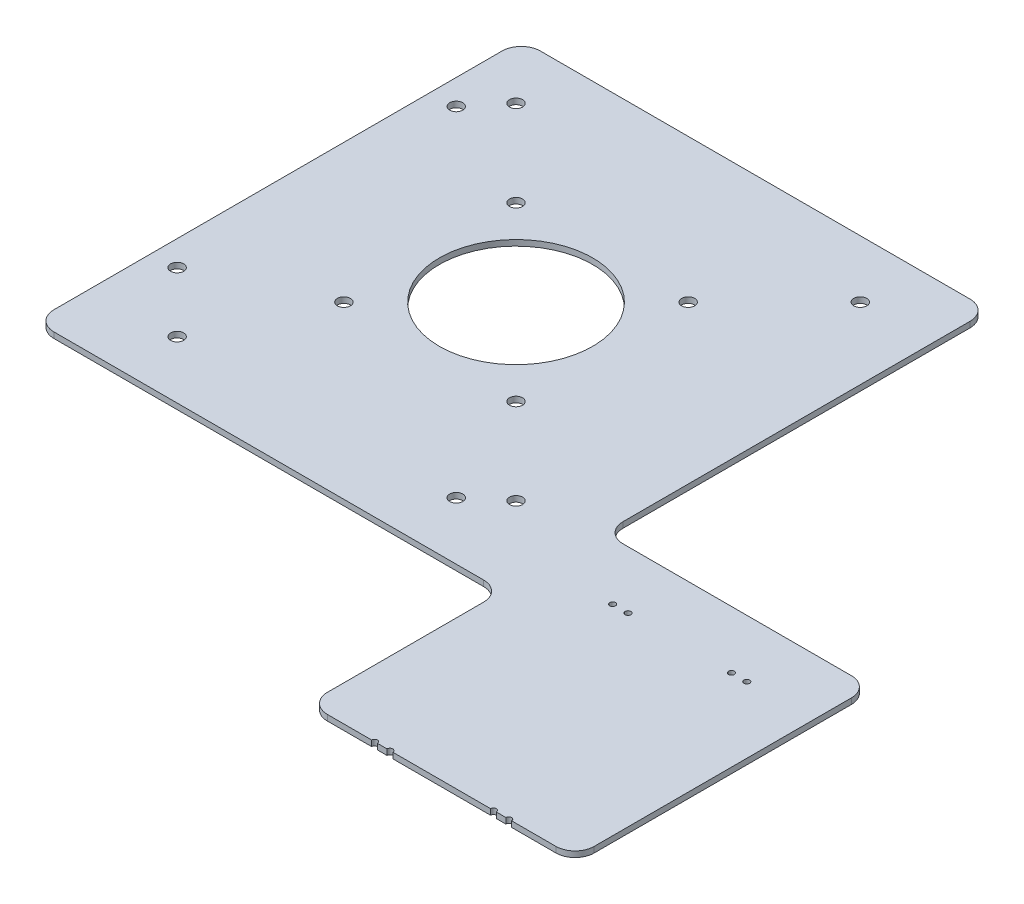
ISO-10303-21;
HEADER;
FILE_DESCRIPTION(('STEP AP214'),'2;1');
FILE_NAME('part.step','',(''),(''),'','','');
FILE_SCHEMA(('AUTOMOTIVE_DESIGN { 1 0 10303 214 1 1 1 1 }'));
ENDSEC;
DATA;
#1=APPLICATION_CONTEXT('core data for automotive mechanical design processes');
#2=APPLICATION_PROTOCOL_DEFINITION('international standard','automotive_design',2000,#1);
#3=PRODUCT_CONTEXT('',#1,'mechanical');
#4=PRODUCT('Part','Part','',(#3));
#5=PRODUCT_RELATED_PRODUCT_CATEGORY('part','',(#4));
#6=PRODUCT_DEFINITION_FORMATION('','',#4);
#7=PRODUCT_DEFINITION_CONTEXT('part definition',#1,'design');
#8=PRODUCT_DEFINITION('design','',#6,#7);
#9=PRODUCT_DEFINITION_SHAPE('','',#8);
#10=(LENGTH_UNIT() NAMED_UNIT(*) SI_UNIT(.MILLI.,.METRE.));
#11=(NAMED_UNIT(*) PLANE_ANGLE_UNIT() SI_UNIT($,.RADIAN.));
#12=(NAMED_UNIT(*) SI_UNIT($,.STERADIAN.) SOLID_ANGLE_UNIT());
#13=UNCERTAINTY_MEASURE_WITH_UNIT(LENGTH_MEASURE(1.E-05),#10,'distance_accuracy_value','');
#14=(GEOMETRIC_REPRESENTATION_CONTEXT(3) GLOBAL_UNCERTAINTY_ASSIGNED_CONTEXT((#13)) GLOBAL_UNIT_ASSIGNED_CONTEXT((#10,
#11,#12)) REPRESENTATION_CONTEXT('',''));
#15=CARTESIAN_POINT('',(0.,0.,0.));
#16=DIRECTION('',(0.,0.,1.));
#17=DIRECTION('',(1.,0.,0.));
#18=AXIS2_PLACEMENT_3D('',#15,#16,#17);
#19=CARTESIAN_POINT('',(256.3,3.,91.3));
#20=DIRECTION('',(0.,1.,0.));
#21=DIRECTION('',(0.,0.,1.));
#22=AXIS2_PLACEMENT_3D('',#19,#20,#21);
#23=PLANE('',#22);
#24=CARTESIAN_POINT('',(223.7,3.,111.3));
#25=DIRECTION('',(0.,1.,0.));
#26=DIRECTION('',(0.,0.,1.));
#27=AXIS2_PLACEMENT_3D('',#24,#25,#26);
#28=CIRCLE('',#27,1.5);
#29=CARTESIAN_POINT('',(223.7,3.,112.8));
#30=VERTEX_POINT('',#29);
#31=EDGE_CURVE('E568',#30,#30,#28,.T.);
#32=ORIENTED_EDGE('',*,*,#31,.F.);
#33=EDGE_LOOP('',(#32));
#34=FACE_BOUND('',#33,.T.);
#35=CARTESIAN_POINT('',(161.7,3.,111.3));
#36=DIRECTION('',(0.,1.,0.));
#37=DIRECTION('',(0.,0.,1.));
#38=AXIS2_PLACEMENT_3D('',#35,#36,#37);
#39=CIRCLE('',#38,1.5);
#40=CARTESIAN_POINT('',(161.7,3.,112.8));
#41=VERTEX_POINT('',#40);
#42=EDGE_CURVE('E580',#41,#41,#39,.T.);
#43=ORIENTED_EDGE('',*,*,#42,.F.);
#44=EDGE_LOOP('',(#43));
#45=FACE_BOUND('',#44,.T.);
#46=CARTESIAN_POINT('',(89.8,3.,89.8));
#47=DIRECTION('',(0.,1.,0.));
#48=DIRECTION('',(0.,0.,1.));
#49=AXIS2_PLACEMENT_3D('',#46,#47,#48);
#50=CIRCLE('',#49,3.4);
#51=CARTESIAN_POINT('',(89.8,3.,93.2));
#52=VERTEX_POINT('',#51);
#53=EDGE_CURVE('E592',#52,#52,#50,.T.);
#54=ORIENTED_EDGE('',*,*,#53,.F.);
#55=EDGE_LOOP('',(#54));
#56=FACE_BOUND('',#55,.T.);
#57=CARTESIAN_POINT('',(-72.8,3.,104.));
#58=DIRECTION('',(0.,1.,0.));
#59=DIRECTION('',(0.,0.,1.));
#60=AXIS2_PLACEMENT_3D('',#57,#58,#59);
#61=CIRCLE('',#60,3.4);
#62=CARTESIAN_POINT('',(-72.8,3.,107.4));
#63=VERTEX_POINT('',#62);
#64=EDGE_CURVE('E604',#63,#63,#61,.T.);
#65=ORIENTED_EDGE('',*,*,#64,.F.);
#66=EDGE_LOOP('',(#65));
#67=FACE_BOUND('',#66,.T.);
#68=CARTESIAN_POINT('',(-44.9,3.,44.9));
#69=DIRECTION('',(0.,1.,0.));
#70=DIRECTION('',(0.,0.,1.));
#71=AXIS2_PLACEMENT_3D('',#68,#69,#70);
#72=CIRCLE('',#71,3.4);
#73=CARTESIAN_POINT('',(-44.9,3.,48.3));
#74=VERTEX_POINT('',#73);
#75=EDGE_CURVE('E616',#74,#74,#72,.T.);
#76=ORIENTED_EDGE('',*,*,#75,.F.);
#77=EDGE_LOOP('',(#76));
#78=FACE_BOUND('',#77,.T.);
#79=CARTESIAN_POINT('',(44.9,3.,-44.9));
#80=DIRECTION('',(0.,1.,0.));
#81=DIRECTION('',(0.,0.,1.));
#82=AXIS2_PLACEMENT_3D('',#79,#80,#81);
#83=CIRCLE('',#82,3.4);
#84=CARTESIAN_POINT('',(44.9,3.,-41.5));
#85=VERTEX_POINT('',#84);
#86=EDGE_CURVE('E628',#85,#85,#83,.T.);
#87=ORIENTED_EDGE('',*,*,#86,.F.);
#88=EDGE_LOOP('',(#87));
#89=FACE_BOUND('',#88,.T.);
#90=CARTESIAN_POINT('',(-89.8,3.,-89.8));
#91=DIRECTION('',(0.,1.,0.));
#92=DIRECTION('',(0.,0.,1.));
#93=AXIS2_PLACEMENT_3D('',#90,#91,#92);
#94=CIRCLE('',#93,3.39999999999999);
#95=CARTESIAN_POINT('',(-89.8,3.,-86.4));
#96=VERTEX_POINT('',#95);
#97=EDGE_CURVE('E640',#96,#96,#94,.T.);
#98=ORIENTED_EDGE('',*,*,#97,.F.);
#99=EDGE_LOOP('',(#98));
#100=FACE_BOUND('',#99,.T.);
#101=CARTESIAN_POINT('',(0.,3.,0.));
#102=DIRECTION('',(0.,1.,0.));
#103=DIRECTION('',(0.,0.,1.));
#104=AXIS2_PLACEMENT_3D('',#101,#102,#103);
#105=CIRCLE('',#104,40.);
#106=CARTESIAN_POINT('',(0.,3.,40.));
#107=VERTEX_POINT('',#106);
#108=EDGE_CURVE('E210',#107,#107,#105,.T.);
#109=ORIENTED_EDGE('',*,*,#108,.F.);
#110=EDGE_LOOP('',(#109));
#111=FACE_BOUND('',#110,.T.);
#112=CARTESIAN_POINT('',(256.3,3.,91.3));
#113=DIRECTION('',(0.,1.,0.));
#114=DIRECTION('',(0.,0.,1.));
#115=AXIS2_PLACEMENT_3D('',#112,#113,#114);
#116=CIRCLE('',#115,9.99999999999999);
#117=CARTESIAN_POINT('',(266.3,3.,91.3));
#118=VERTEX_POINT('',#117);
#119=CARTESIAN_POINT('',(256.3,3.,81.3));
#120=VERTEX_POINT('',#119);
#121=EDGE_CURVE('E260',#118,#120,#116,.T.);
#122=ORIENTED_EDGE('',*,*,#121,.T.);
#123=DIRECTION('',(-1.,0.,0.));
#124=VECTOR('',#123,1.);
#125=CARTESIAN_POINT('',(256.3,3.,81.3));
#126=LINE('',#125,#124);
#127=CARTESIAN_POINT('',(137.1,3.,81.3));
#128=VERTEX_POINT('',#127);
#129=EDGE_CURVE('E205',#120,#128,#126,.T.);
#130=ORIENTED_EDGE('',*,*,#129,.T.);
#131=CARTESIAN_POINT('',(137.1,3.,71.3));
#132=DIRECTION('',(0.,-1.,0.));
#133=DIRECTION('',(0.,0.,1.));
#134=AXIS2_PLACEMENT_3D('',#131,#132,#133);
#135=CIRCLE('',#134,10.);
#136=CARTESIAN_POINT('',(127.1,3.,71.3));
#137=VERTEX_POINT('',#136);
#138=EDGE_CURVE('E263',#128,#137,#135,.T.);
#139=ORIENTED_EDGE('',*,*,#138,.T.);
#140=DIRECTION('',(0.,0.,-1.));
#141=VECTOR('',#140,1.);
#142=CARTESIAN_POINT('',(127.1,3.,71.3));
#143=LINE('',#142,#141);
#144=CARTESIAN_POINT('',(127.1,3.,-109.8));
#145=VERTEX_POINT('',#144);
#146=EDGE_CURVE('E265',#137,#145,#143,.T.);
#147=ORIENTED_EDGE('',*,*,#146,.T.);
#148=CARTESIAN_POINT('',(117.1,3.,-109.8));
#149=DIRECTION('',(0.,1.,0.));
#150=DIRECTION('',(0.,0.,1.));
#151=AXIS2_PLACEMENT_3D('',#148,#149,#150);
#152=CIRCLE('',#151,10.);
#153=CARTESIAN_POINT('',(117.1,3.,-119.8));
#154=VERTEX_POINT('',#153);
#155=EDGE_CURVE('E267',#145,#154,#152,.T.);
#156=ORIENTED_EDGE('',*,*,#155,.T.);
#157=DIRECTION('',(-1.,0.,0.));
#158=VECTOR('',#157,1.);
#159=CARTESIAN_POINT('',(117.1,3.,-119.8));
#160=LINE('',#159,#158);
#161=CARTESIAN_POINT('',(-107.1,3.,-119.8));
#162=VERTEX_POINT('',#161);
#163=EDGE_CURVE('E269',#154,#162,#160,.T.);
#164=ORIENTED_EDGE('',*,*,#163,.T.);
#165=CARTESIAN_POINT('',(-107.1,3.,-109.8));
#166=DIRECTION('',(0.,1.,0.));
#167=DIRECTION('',(0.,0.,1.));
#168=AXIS2_PLACEMENT_3D('',#165,#166,#167);
#169=CIRCLE('',#168,10.);
#170=CARTESIAN_POINT('',(-117.1,3.,-109.8));
#171=VERTEX_POINT('',#170);
#172=EDGE_CURVE('E271',#162,#171,#169,.T.);
#173=ORIENTED_EDGE('',*,*,#172,.T.);
#174=DIRECTION('',(0.,0.,1.));
#175=VECTOR('',#174,1.);
#176=CARTESIAN_POINT('',(-117.1,3.,-109.8));
#177=LINE('',#176,#175);
#178=CARTESIAN_POINT('',(-117.1,3.,124.));
#179=VERTEX_POINT('',#178);
#180=EDGE_CURVE('E273',#171,#179,#177,.T.);
#181=ORIENTED_EDGE('',*,*,#180,.T.);
#182=CARTESIAN_POINT('',(-107.1,3.,124.));
#183=DIRECTION('',(0.,1.,0.));
#184=DIRECTION('',(0.,0.,1.));
#185=AXIS2_PLACEMENT_3D('',#182,#183,#184);
#186=CIRCLE('',#185,9.99999999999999);
#187=CARTESIAN_POINT('',(-107.1,3.,134.));
#188=VERTEX_POINT('',#187);
#189=EDGE_CURVE('E275',#179,#188,#186,.T.);
#190=ORIENTED_EDGE('',*,*,#189,.T.);
#191=DIRECTION('',(1.,0.,0.));
#192=VECTOR('',#191,1.);
#193=CARTESIAN_POINT('',(-107.1,3.,134.));
#194=LINE('',#193,#192);
#195=CARTESIAN_POINT('',(117.1,3.,134.));
#196=VERTEX_POINT('',#195);
#197=EDGE_CURVE('E277',#188,#196,#194,.T.);
#198=ORIENTED_EDGE('',*,*,#197,.T.);
#199=CARTESIAN_POINT('',(117.1,3.,144.));
#200=DIRECTION('',(0.,-1.,0.));
#201=DIRECTION('',(0.,0.,-1.));
#202=AXIS2_PLACEMENT_3D('',#199,#200,#201);
#203=CIRCLE('',#202,10.);
#204=CARTESIAN_POINT('',(127.1,3.,144.));
#205=VERTEX_POINT('',#204);
#206=EDGE_CURVE('E279',#196,#205,#203,.T.);
#207=ORIENTED_EDGE('',*,*,#206,.T.);
#208=DIRECTION('',(0.,0.,1.));
#209=VECTOR('',#208,1.);
#210=CARTESIAN_POINT('',(127.1,3.,144.));
#211=LINE('',#210,#209);
#212=CARTESIAN_POINT('',(127.1,3.,225.5));
#213=VERTEX_POINT('',#212);
#214=EDGE_CURVE('E281',#205,#213,#211,.T.);
#215=ORIENTED_EDGE('',*,*,#214,.T.);
#216=CARTESIAN_POINT('',(137.1,3.,225.5));
#217=DIRECTION('',(0.,1.,0.));
#218=DIRECTION('',(0.,0.,1.));
#219=AXIS2_PLACEMENT_3D('',#216,#217,#218);
#220=CIRCLE('',#219,10.);
#221=CARTESIAN_POINT('',(137.1,3.,235.5));
#222=VERTEX_POINT('',#221);
#223=EDGE_CURVE('E283',#213,#222,#220,.T.);
#224=ORIENTED_EDGE('',*,*,#223,.T.);
#225=DIRECTION('',(1.,0.,0.));
#226=VECTOR('',#225,1.);
#227=CARTESIAN_POINT('',(137.1,3.,235.5));
#228=LINE('',#227,#226);
#229=CARTESIAN_POINT('',(160.2,3.,235.5));
#230=VERTEX_POINT('',#229);
#231=EDGE_CURVE('E285',#222,#230,#228,.T.);
#232=ORIENTED_EDGE('',*,*,#231,.T.);
#233=CARTESIAN_POINT('',(161.7,3.,235.5));
#234=DIRECTION('',(0.,-1.,0.));
#235=DIRECTION('',(0.,0.,-1.));
#236=AXIS2_PLACEMENT_3D('',#233,#234,#235);
#237=CIRCLE('',#236,1.49999999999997);
#238=CARTESIAN_POINT('',(163.2,3.,235.5));
#239=VERTEX_POINT('',#238);
#240=EDGE_CURVE('E287',#230,#239,#237,.T.);
#241=ORIENTED_EDGE('',*,*,#240,.T.);
#242=DIRECTION('',(1.,0.,0.));
#243=VECTOR('',#242,1.);
#244=CARTESIAN_POINT('',(163.2,3.,235.5));
#245=LINE('',#244,#243);
#246=CARTESIAN_POINT('',(168.2,3.,235.5));
#247=VERTEX_POINT('',#246);
#248=EDGE_CURVE('E289',#239,#247,#245,.T.);
#249=ORIENTED_EDGE('',*,*,#248,.T.);
#250=CARTESIAN_POINT('',(169.7,3.,235.5));
#251=DIRECTION('',(0.,-1.,0.));
#252=DIRECTION('',(0.,0.,-1.));
#253=AXIS2_PLACEMENT_3D('',#250,#251,#252);
#254=CIRCLE('',#253,1.5);
#255=CARTESIAN_POINT('',(171.2,3.,235.5));
#256=VERTEX_POINT('',#255);
#257=EDGE_CURVE('E291',#247,#256,#254,.T.);
#258=ORIENTED_EDGE('',*,*,#257,.T.);
#259=DIRECTION('',(1.,0.,0.));
#260=VECTOR('',#259,1.);
#261=CARTESIAN_POINT('',(171.2,3.,235.5));
#262=LINE('',#261,#260);
#263=CARTESIAN_POINT('',(222.2,3.,235.5));
#264=VERTEX_POINT('',#263);
#265=EDGE_CURVE('E293',#256,#264,#262,.T.);
#266=ORIENTED_EDGE('',*,*,#265,.T.);
#267=CARTESIAN_POINT('',(223.7,3.,235.5));
#268=DIRECTION('',(0.,-1.,0.));
#269=DIRECTION('',(0.,0.,-1.));
#270=AXIS2_PLACEMENT_3D('',#267,#268,#269);
#271=CIRCLE('',#270,1.5);
#272=CARTESIAN_POINT('',(225.2,3.,235.5));
#273=VERTEX_POINT('',#272);
#274=EDGE_CURVE('E295',#264,#273,#271,.T.);
#275=ORIENTED_EDGE('',*,*,#274,.T.);
#276=DIRECTION('',(1.,0.,0.));
#277=VECTOR('',#276,1.);
#278=CARTESIAN_POINT('',(225.2,3.,235.5));
#279=LINE('',#278,#277);
#280=CARTESIAN_POINT('',(230.2,3.,235.5));
#281=VERTEX_POINT('',#280);
#282=EDGE_CURVE('E297',#273,#281,#279,.T.);
#283=ORIENTED_EDGE('',*,*,#282,.T.);
#284=CARTESIAN_POINT('',(231.7,3.,235.5));
#285=DIRECTION('',(0.,-1.,0.));
#286=DIRECTION('',(0.,0.,-1.));
#287=AXIS2_PLACEMENT_3D('',#284,#285,#286);
#288=CIRCLE('',#287,1.5);
#289=CARTESIAN_POINT('',(233.2,3.,235.5));
#290=VERTEX_POINT('',#289);
#291=EDGE_CURVE('E299',#281,#290,#288,.T.);
#292=ORIENTED_EDGE('',*,*,#291,.T.);
#293=DIRECTION('',(1.,0.,0.));
#294=VECTOR('',#293,1.);
#295=CARTESIAN_POINT('',(233.2,3.,235.5));
#296=LINE('',#295,#294);
#297=CARTESIAN_POINT('',(256.3,3.,235.5));
#298=VERTEX_POINT('',#297);
#299=EDGE_CURVE('E301',#290,#298,#296,.T.);
#300=ORIENTED_EDGE('',*,*,#299,.T.);
#301=CARTESIAN_POINT('',(256.3,3.,225.5));
#302=DIRECTION('',(0.,1.,0.));
#303=DIRECTION('',(0.,0.,1.));
#304=AXIS2_PLACEMENT_3D('',#301,#302,#303);
#305=CIRCLE('',#304,10.);
#306=CARTESIAN_POINT('',(266.3,3.,225.5));
#307=VERTEX_POINT('',#306);
#308=EDGE_CURVE('E50',#298,#307,#305,.T.);
#309=ORIENTED_EDGE('',*,*,#308,.T.);
#310=DIRECTION('',(0.,0.,-1.));
#311=VECTOR('',#310,1.);
#312=CARTESIAN_POINT('',(266.3,3.,225.5));
#313=LINE('',#312,#311);
#314=EDGE_CURVE('E45',#307,#118,#313,.T.);
#315=ORIENTED_EDGE('',*,*,#314,.T.);
#316=EDGE_LOOP('',(#122,#130,#139,#147,#156,#164,#173,#181,#190,#198,#207,#215,#224,#232,#241,
#249,#258,#266,#275,#283,#292,#300,#309,#315));
#317=FACE_BOUND('',#316,.T.);
#318=CARTESIAN_POINT('',(-104.,3.,-72.8));
#319=DIRECTION('',(0.,1.,0.));
#320=DIRECTION('',(0.,0.,1.));
#321=AXIS2_PLACEMENT_3D('',#318,#319,#320);
#322=CIRCLE('',#321,3.4);
#323=CARTESIAN_POINT('',(-104.,3.,-69.4));
#324=VERTEX_POINT('',#323);
#325=EDGE_CURVE('E646',#324,#324,#322,.T.);
#326=ORIENTED_EDGE('',*,*,#325,.F.);
#327=EDGE_LOOP('',(#326));
#328=FACE_BOUND('',#327,.T.);
#329=CARTESIAN_POINT('',(-44.9,3.,-44.9));
#330=DIRECTION('',(0.,1.,0.));
#331=DIRECTION('',(0.,0.,1.));
#332=AXIS2_PLACEMENT_3D('',#329,#330,#331);
#333=CIRCLE('',#332,3.4);
#334=CARTESIAN_POINT('',(-44.9,3.,-41.5));
#335=VERTEX_POINT('',#334);
#336=EDGE_CURVE('E634',#335,#335,#333,.T.);
#337=ORIENTED_EDGE('',*,*,#336,.F.);
#338=EDGE_LOOP('',(#337));
#339=FACE_BOUND('',#338,.T.);
#340=CARTESIAN_POINT('',(44.9,3.,44.9));
#341=DIRECTION('',(0.,1.,0.));
#342=DIRECTION('',(0.,0.,1.));
#343=AXIS2_PLACEMENT_3D('',#340,#341,#342);
#344=CIRCLE('',#343,3.4);
#345=CARTESIAN_POINT('',(44.9,3.,48.3));
#346=VERTEX_POINT('',#345);
#347=EDGE_CURVE('E622',#346,#346,#344,.T.);
#348=ORIENTED_EDGE('',*,*,#347,.F.);
#349=EDGE_LOOP('',(#348));
#350=FACE_BOUND('',#349,.T.);
#351=CARTESIAN_POINT('',(-104.,3.,72.8));
#352=DIRECTION('',(0.,1.,0.));
#353=DIRECTION('',(0.,0.,1.));
#354=AXIS2_PLACEMENT_3D('',#351,#352,#353);
#355=CIRCLE('',#354,3.4);
#356=CARTESIAN_POINT('',(-104.,3.,76.2));
#357=VERTEX_POINT('',#356);
#358=EDGE_CURVE('E610',#357,#357,#355,.T.);
#359=ORIENTED_EDGE('',*,*,#358,.F.);
#360=EDGE_LOOP('',(#359));
#361=FACE_BOUND('',#360,.T.);
#362=CARTESIAN_POINT('',(72.8,3.,104.));
#363=DIRECTION('',(0.,1.,0.));
#364=DIRECTION('',(0.,0.,1.));
#365=AXIS2_PLACEMENT_3D('',#362,#363,#364);
#366=CIRCLE('',#365,3.4);
#367=CARTESIAN_POINT('',(72.8,3.,107.4));
#368=VERTEX_POINT('',#367);
#369=EDGE_CURVE('E598',#368,#368,#366,.T.);
#370=ORIENTED_EDGE('',*,*,#369,.F.);
#371=EDGE_LOOP('',(#370));
#372=FACE_BOUND('',#371,.T.);
#373=CARTESIAN_POINT('',(89.8,3.,-89.8));
#374=DIRECTION('',(0.,1.,0.));
#375=DIRECTION('',(0.,0.,1.));
#376=AXIS2_PLACEMENT_3D('',#373,#374,#375);
#377=CIRCLE('',#376,3.4);
#378=CARTESIAN_POINT('',(89.8,3.,-86.4));
#379=VERTEX_POINT('',#378);
#380=EDGE_CURVE('E586',#379,#379,#377,.T.);
#381=ORIENTED_EDGE('',*,*,#380,.F.);
#382=EDGE_LOOP('',(#381));
#383=FACE_BOUND('',#382,.T.);
#384=CARTESIAN_POINT('',(169.7,3.,111.3));
#385=DIRECTION('',(0.,1.,0.));
#386=DIRECTION('',(0.,0.,1.));
#387=AXIS2_PLACEMENT_3D('',#384,#385,#386);
#388=CIRCLE('',#387,1.5);
#389=CARTESIAN_POINT('',(169.7,3.,112.8));
#390=VERTEX_POINT('',#389);
#391=EDGE_CURVE('E574',#390,#390,#388,.T.);
#392=ORIENTED_EDGE('',*,*,#391,.F.);
#393=EDGE_LOOP('',(#392));
#394=FACE_BOUND('',#393,.T.);
#395=CARTESIAN_POINT('',(231.7,3.,111.3));
#396=DIRECTION('',(0.,1.,0.));
#397=DIRECTION('',(0.,0.,1.));
#398=AXIS2_PLACEMENT_3D('',#395,#396,#397);
#399=CIRCLE('',#398,1.5);
#400=CARTESIAN_POINT('',(231.7,3.,112.8));
#401=VERTEX_POINT('',#400);
#402=EDGE_CURVE('E557',#401,#401,#399,.T.);
#403=ORIENTED_EDGE('',*,*,#402,.F.);
#404=EDGE_LOOP('',(#403));
#405=FACE_BOUND('',#404,.T.);
#406=ADVANCED_FACE('F30',(#34,#45,#56,#67,#78,#89,#100,#111,#317,#328,#339,#350,#361,#372,#383,
#394,#405),#23,.T.);
#407=CARTESIAN_POINT('',(256.3,0.,91.3));
#408=DIRECTION('',(0.,1.,0.));
#409=DIRECTION('',(0.,0.,1.));
#410=AXIS2_PLACEMENT_3D('',#407,#408,#409);
#411=PLANE('',#410);
#412=CARTESIAN_POINT('',(223.7,0.,111.3));
#413=DIRECTION('',(0.,1.,0.));
#414=DIRECTION('',(0.,0.,1.));
#415=AXIS2_PLACEMENT_3D('',#412,#413,#414);
#416=CIRCLE('',#415,1.5);
#417=CARTESIAN_POINT('',(223.7,0.,112.8));
#418=VERTEX_POINT('',#417);
#419=EDGE_CURVE('E563',#418,#418,#416,.T.);
#420=ORIENTED_EDGE('',*,*,#419,.T.);
#421=EDGE_LOOP('',(#420));
#422=FACE_BOUND('',#421,.T.);
#423=CARTESIAN_POINT('',(161.7,0.,111.3));
#424=DIRECTION('',(0.,1.,0.));
#425=DIRECTION('',(0.,0.,1.));
#426=AXIS2_PLACEMENT_3D('',#423,#424,#425);
#427=CIRCLE('',#426,1.5);
#428=CARTESIAN_POINT('',(161.7,0.,112.8));
#429=VERTEX_POINT('',#428);
#430=EDGE_CURVE('E577',#429,#429,#427,.T.);
#431=ORIENTED_EDGE('',*,*,#430,.T.);
#432=EDGE_LOOP('',(#431));
#433=FACE_BOUND('',#432,.T.);
#434=CARTESIAN_POINT('',(89.8,0.,89.8));
#435=DIRECTION('',(0.,1.,0.));
#436=DIRECTION('',(0.,0.,1.));
#437=AXIS2_PLACEMENT_3D('',#434,#435,#436);
#438=CIRCLE('',#437,3.4);
#439=CARTESIAN_POINT('',(89.8,0.,93.2));
#440=VERTEX_POINT('',#439);
#441=EDGE_CURVE('E589',#440,#440,#438,.T.);
#442=ORIENTED_EDGE('',*,*,#441,.T.);
#443=EDGE_LOOP('',(#442));
#444=FACE_BOUND('',#443,.T.);
#445=CARTESIAN_POINT('',(-72.8,0.,104.));
#446=DIRECTION('',(0.,1.,0.));
#447=DIRECTION('',(0.,0.,1.));
#448=AXIS2_PLACEMENT_3D('',#445,#446,#447);
#449=CIRCLE('',#448,3.4);
#450=CARTESIAN_POINT('',(-72.8,0.,107.4));
#451=VERTEX_POINT('',#450);
#452=EDGE_CURVE('E601',#451,#451,#449,.T.);
#453=ORIENTED_EDGE('',*,*,#452,.T.);
#454=EDGE_LOOP('',(#453));
#455=FACE_BOUND('',#454,.T.);
#456=CARTESIAN_POINT('',(-44.9,0.,44.9));
#457=DIRECTION('',(0.,1.,0.));
#458=DIRECTION('',(0.,0.,1.));
#459=AXIS2_PLACEMENT_3D('',#456,#457,#458);
#460=CIRCLE('',#459,3.4);
#461=CARTESIAN_POINT('',(-44.9,0.,48.3));
#462=VERTEX_POINT('',#461);
#463=EDGE_CURVE('E613',#462,#462,#460,.T.);
#464=ORIENTED_EDGE('',*,*,#463,.T.);
#465=EDGE_LOOP('',(#464));
#466=FACE_BOUND('',#465,.T.);
#467=CARTESIAN_POINT('',(44.9,0.,-44.9));
#468=DIRECTION('',(0.,1.,0.));
#469=DIRECTION('',(0.,0.,1.));
#470=AXIS2_PLACEMENT_3D('',#467,#468,#469);
#471=CIRCLE('',#470,3.4);
#472=CARTESIAN_POINT('',(44.9,0.,-41.5));
#473=VERTEX_POINT('',#472);
#474=EDGE_CURVE('E625',#473,#473,#471,.T.);
#475=ORIENTED_EDGE('',*,*,#474,.T.);
#476=EDGE_LOOP('',(#475));
#477=FACE_BOUND('',#476,.T.);
#478=CARTESIAN_POINT('',(-89.8,0.,-89.8));
#479=DIRECTION('',(0.,1.,0.));
#480=DIRECTION('',(0.,0.,1.));
#481=AXIS2_PLACEMENT_3D('',#478,#479,#480);
#482=CIRCLE('',#481,3.39999999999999);
#483=CARTESIAN_POINT('',(-89.8,0.,-86.4));
#484=VERTEX_POINT('',#483);
#485=EDGE_CURVE('E637',#484,#484,#482,.T.);
#486=ORIENTED_EDGE('',*,*,#485,.T.);
#487=EDGE_LOOP('',(#486));
#488=FACE_BOUND('',#487,.T.);
#489=CARTESIAN_POINT('',(0.,0.,0.));
#490=DIRECTION('',(0.,1.,0.));
#491=DIRECTION('',(0.,0.,1.));
#492=AXIS2_PLACEMENT_3D('',#489,#490,#491);
#493=CIRCLE('',#492,40.);
#494=CARTESIAN_POINT('',(0.,0.,40.));
#495=VERTEX_POINT('',#494);
#496=EDGE_CURVE('E213',#495,#495,#493,.T.);
#497=ORIENTED_EDGE('',*,*,#496,.T.);
#498=EDGE_LOOP('',(#497));
#499=FACE_BOUND('',#498,.T.);
#500=CARTESIAN_POINT('',(256.3,0.,91.3));
#501=DIRECTION('',(0.,1.,0.));
#502=DIRECTION('',(0.,0.,1.));
#503=AXIS2_PLACEMENT_3D('',#500,#501,#502);
#504=CIRCLE('',#503,9.99999999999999);
#505=CARTESIAN_POINT('',(266.3,0.,91.3));
#506=VERTEX_POINT('',#505);
#507=CARTESIAN_POINT('',(256.3,0.,81.3));
#508=VERTEX_POINT('',#507);
#509=EDGE_CURVE('E196',#506,#508,#504,.T.);
#510=ORIENTED_EDGE('',*,*,#509,.F.);
#511=DIRECTION('',(0.,0.,-1.));
#512=VECTOR('',#511,1.);
#513=CARTESIAN_POINT('',(266.3,0.,225.5));
#514=LINE('',#513,#512);
#515=CARTESIAN_POINT('',(266.3,0.,225.5));
#516=VERTEX_POINT('',#515);
#517=EDGE_CURVE('E258',#516,#506,#514,.T.);
#518=ORIENTED_EDGE('',*,*,#517,.F.);
#519=CARTESIAN_POINT('',(256.3,0.,225.5));
#520=DIRECTION('',(0.,1.,0.));
#521=DIRECTION('',(0.,0.,1.));
#522=AXIS2_PLACEMENT_3D('',#519,#520,#521);
#523=CIRCLE('',#522,10.);
#524=CARTESIAN_POINT('',(256.3,0.,235.5));
#525=VERTEX_POINT('',#524);
#526=EDGE_CURVE('E256',#525,#516,#523,.T.);
#527=ORIENTED_EDGE('',*,*,#526,.F.);
#528=DIRECTION('',(1.,0.,0.));
#529=VECTOR('',#528,1.);
#530=CARTESIAN_POINT('',(233.2,0.,235.5));
#531=LINE('',#530,#529);
#532=CARTESIAN_POINT('',(233.2,0.,235.5));
#533=VERTEX_POINT('',#532);
#534=EDGE_CURVE('E254',#533,#525,#531,.T.);
#535=ORIENTED_EDGE('',*,*,#534,.F.);
#536=CARTESIAN_POINT('',(231.7,0.,235.5));
#537=DIRECTION('',(0.,-1.,0.));
#538=DIRECTION('',(0.,0.,-1.));
#539=AXIS2_PLACEMENT_3D('',#536,#537,#538);
#540=CIRCLE('',#539,1.5);
#541=CARTESIAN_POINT('',(230.2,0.,235.5));
#542=VERTEX_POINT('',#541);
#543=EDGE_CURVE('E252',#542,#533,#540,.T.);
#544=ORIENTED_EDGE('',*,*,#543,.F.);
#545=DIRECTION('',(1.,0.,0.));
#546=VECTOR('',#545,1.);
#547=CARTESIAN_POINT('',(225.2,0.,235.5));
#548=LINE('',#547,#546);
#549=CARTESIAN_POINT('',(225.2,0.,235.5));
#550=VERTEX_POINT('',#549);
#551=EDGE_CURVE('E250',#550,#542,#548,.T.);
#552=ORIENTED_EDGE('',*,*,#551,.F.);
#553=CARTESIAN_POINT('',(223.7,0.,235.5));
#554=DIRECTION('',(0.,-1.,0.));
#555=DIRECTION('',(0.,0.,-1.));
#556=AXIS2_PLACEMENT_3D('',#553,#554,#555);
#557=CIRCLE('',#556,1.5);
#558=CARTESIAN_POINT('',(222.2,0.,235.5));
#559=VERTEX_POINT('',#558);
#560=EDGE_CURVE('E248',#559,#550,#557,.T.);
#561=ORIENTED_EDGE('',*,*,#560,.F.);
#562=DIRECTION('',(1.,0.,0.));
#563=VECTOR('',#562,1.);
#564=CARTESIAN_POINT('',(171.2,0.,235.5));
#565=LINE('',#564,#563);
#566=CARTESIAN_POINT('',(171.2,0.,235.5));
#567=VERTEX_POINT('',#566);
#568=EDGE_CURVE('E246',#567,#559,#565,.T.);
#569=ORIENTED_EDGE('',*,*,#568,.F.);
#570=CARTESIAN_POINT('',(169.7,0.,235.5));
#571=DIRECTION('',(0.,-1.,0.));
#572=DIRECTION('',(0.,0.,-1.));
#573=AXIS2_PLACEMENT_3D('',#570,#571,#572);
#574=CIRCLE('',#573,1.5);
#575=CARTESIAN_POINT('',(168.2,0.,235.5));
#576=VERTEX_POINT('',#575);
#577=EDGE_CURVE('E244',#576,#567,#574,.T.);
#578=ORIENTED_EDGE('',*,*,#577,.F.);
#579=DIRECTION('',(1.,0.,0.));
#580=VECTOR('',#579,1.);
#581=CARTESIAN_POINT('',(163.2,0.,235.5));
#582=LINE('',#581,#580);
#583=CARTESIAN_POINT('',(163.2,0.,235.5));
#584=VERTEX_POINT('',#583);
#585=EDGE_CURVE('E242',#584,#576,#582,.T.);
#586=ORIENTED_EDGE('',*,*,#585,.F.);
#587=CARTESIAN_POINT('',(161.7,0.,235.5));
#588=DIRECTION('',(0.,-1.,0.));
#589=DIRECTION('',(0.,0.,-1.));
#590=AXIS2_PLACEMENT_3D('',#587,#588,#589);
#591=CIRCLE('',#590,1.49999999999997);
#592=CARTESIAN_POINT('',(160.2,0.,235.5));
#593=VERTEX_POINT('',#592);
#594=EDGE_CURVE('E240',#593,#584,#591,.T.);
#595=ORIENTED_EDGE('',*,*,#594,.F.);
#596=DIRECTION('',(1.,0.,0.));
#597=VECTOR('',#596,1.);
#598=CARTESIAN_POINT('',(137.1,0.,235.5));
#599=LINE('',#598,#597);
#600=CARTESIAN_POINT('',(137.1,0.,235.5));
#601=VERTEX_POINT('',#600);
#602=EDGE_CURVE('E238',#601,#593,#599,.T.);
#603=ORIENTED_EDGE('',*,*,#602,.F.);
#604=CARTESIAN_POINT('',(137.1,0.,225.5));
#605=DIRECTION('',(0.,1.,0.));
#606=DIRECTION('',(0.,0.,1.));
#607=AXIS2_PLACEMENT_3D('',#604,#605,#606);
#608=CIRCLE('',#607,10.);
#609=CARTESIAN_POINT('',(127.1,0.,225.5));
#610=VERTEX_POINT('',#609);
#611=EDGE_CURVE('E236',#610,#601,#608,.T.);
#612=ORIENTED_EDGE('',*,*,#611,.F.);
#613=DIRECTION('',(0.,0.,1.));
#614=VECTOR('',#613,1.);
#615=CARTESIAN_POINT('',(127.1,0.,144.));
#616=LINE('',#615,#614);
#617=CARTESIAN_POINT('',(127.1,0.,144.));
#618=VERTEX_POINT('',#617);
#619=EDGE_CURVE('E234',#618,#610,#616,.T.);
#620=ORIENTED_EDGE('',*,*,#619,.F.);
#621=CARTESIAN_POINT('',(117.1,0.,144.));
#622=DIRECTION('',(0.,-1.,0.));
#623=DIRECTION('',(0.,0.,-1.));
#624=AXIS2_PLACEMENT_3D('',#621,#622,#623);
#625=CIRCLE('',#624,10.);
#626=CARTESIAN_POINT('',(117.1,0.,134.));
#627=VERTEX_POINT('',#626);
#628=EDGE_CURVE('E232',#627,#618,#625,.T.);
#629=ORIENTED_EDGE('',*,*,#628,.F.);
#630=DIRECTION('',(1.,0.,0.));
#631=VECTOR('',#630,1.);
#632=CARTESIAN_POINT('',(-107.1,0.,134.));
#633=LINE('',#632,#631);
#634=CARTESIAN_POINT('',(-107.1,0.,134.));
#635=VERTEX_POINT('',#634);
#636=EDGE_CURVE('E230',#635,#627,#633,.T.);
#637=ORIENTED_EDGE('',*,*,#636,.F.);
#638=CARTESIAN_POINT('',(-107.1,0.,124.));
#639=DIRECTION('',(0.,1.,0.));
#640=DIRECTION('',(0.,0.,1.));
#641=AXIS2_PLACEMENT_3D('',#638,#639,#640);
#642=CIRCLE('',#641,9.99999999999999);
#643=CARTESIAN_POINT('',(-117.1,0.,124.));
#644=VERTEX_POINT('',#643);
#645=EDGE_CURVE('E228',#644,#635,#642,.T.);
#646=ORIENTED_EDGE('',*,*,#645,.F.);
#647=DIRECTION('',(0.,0.,1.));
#648=VECTOR('',#647,1.);
#649=CARTESIAN_POINT('',(-117.1,0.,-109.8));
#650=LINE('',#649,#648);
#651=CARTESIAN_POINT('',(-117.1,0.,-109.8));
#652=VERTEX_POINT('',#651);
#653=EDGE_CURVE('E226',#652,#644,#650,.T.);
#654=ORIENTED_EDGE('',*,*,#653,.F.);
#655=CARTESIAN_POINT('',(-107.1,0.,-109.8));
#656=DIRECTION('',(0.,1.,0.));
#657=DIRECTION('',(0.,0.,1.));
#658=AXIS2_PLACEMENT_3D('',#655,#656,#657);
#659=CIRCLE('',#658,10.);
#660=CARTESIAN_POINT('',(-107.1,0.,-119.8));
#661=VERTEX_POINT('',#660);
#662=EDGE_CURVE('E224',#661,#652,#659,.T.);
#663=ORIENTED_EDGE('',*,*,#662,.F.);
#664=DIRECTION('',(-1.,0.,0.));
#665=VECTOR('',#664,1.);
#666=CARTESIAN_POINT('',(117.1,0.,-119.8));
#667=LINE('',#666,#665);
#668=CARTESIAN_POINT('',(117.1,0.,-119.8));
#669=VERTEX_POINT('',#668);
#670=EDGE_CURVE('E222',#669,#661,#667,.T.);
#671=ORIENTED_EDGE('',*,*,#670,.F.);
#672=CARTESIAN_POINT('',(117.1,0.,-109.8));
#673=DIRECTION('',(0.,1.,0.));
#674=DIRECTION('',(0.,0.,1.));
#675=AXIS2_PLACEMENT_3D('',#672,#673,#674);
#676=CIRCLE('',#675,10.);
#677=CARTESIAN_POINT('',(127.1,0.,-109.8));
#678=VERTEX_POINT('',#677);
#679=EDGE_CURVE('E220',#678,#669,#676,.T.);
#680=ORIENTED_EDGE('',*,*,#679,.F.);
#681=DIRECTION('',(0.,0.,-1.));
#682=VECTOR('',#681,1.);
#683=CARTESIAN_POINT('',(127.1,0.,71.3));
#684=LINE('',#683,#682);
#685=CARTESIAN_POINT('',(127.1,0.,71.3));
#686=VERTEX_POINT('',#685);
#687=EDGE_CURVE('E218',#686,#678,#684,.T.);
#688=ORIENTED_EDGE('',*,*,#687,.F.);
#689=CARTESIAN_POINT('',(137.1,0.,71.3));
#690=DIRECTION('',(0.,-1.,0.));
#691=DIRECTION('',(0.,0.,1.));
#692=AXIS2_PLACEMENT_3D('',#689,#690,#691);
#693=CIRCLE('',#692,10.);
#694=CARTESIAN_POINT('',(137.1,0.,81.3));
#695=VERTEX_POINT('',#694);
#696=EDGE_CURVE('E198',#695,#686,#693,.T.);
#697=ORIENTED_EDGE('',*,*,#696,.F.);
#698=DIRECTION('',(-1.,0.,0.));
#699=VECTOR('',#698,1.);
#700=CARTESIAN_POINT('',(256.3,0.,81.3));
#701=LINE('',#700,#699);
#702=EDGE_CURVE('E191',#508,#695,#701,.T.);
#703=ORIENTED_EDGE('',*,*,#702,.F.);
#704=EDGE_LOOP('',(#510,#518,#527,#535,#544,#552,#561,#569,#578,#586,#595,#603,#612,#620,#629,
#637,#646,#654,#663,#671,#680,#688,#697,#703));
#705=FACE_BOUND('',#704,.T.);
#706=CARTESIAN_POINT('',(-104.,0.,-72.8));
#707=DIRECTION('',(0.,1.,0.));
#708=DIRECTION('',(0.,0.,1.));
#709=AXIS2_PLACEMENT_3D('',#706,#707,#708);
#710=CIRCLE('',#709,3.4);
#711=CARTESIAN_POINT('',(-104.,0.,-69.4));
#712=VERTEX_POINT('',#711);
#713=EDGE_CURVE('E643',#712,#712,#710,.T.);
#714=ORIENTED_EDGE('',*,*,#713,.T.);
#715=EDGE_LOOP('',(#714));
#716=FACE_BOUND('',#715,.T.);
#717=CARTESIAN_POINT('',(-44.9,0.,-44.9));
#718=DIRECTION('',(0.,1.,0.));
#719=DIRECTION('',(0.,0.,1.));
#720=AXIS2_PLACEMENT_3D('',#717,#718,#719);
#721=CIRCLE('',#720,3.4);
#722=CARTESIAN_POINT('',(-44.9,0.,-41.5));
#723=VERTEX_POINT('',#722);
#724=EDGE_CURVE('E631',#723,#723,#721,.T.);
#725=ORIENTED_EDGE('',*,*,#724,.T.);
#726=EDGE_LOOP('',(#725));
#727=FACE_BOUND('',#726,.T.);
#728=CARTESIAN_POINT('',(44.9,0.,44.9));
#729=DIRECTION('',(0.,1.,0.));
#730=DIRECTION('',(0.,0.,1.));
#731=AXIS2_PLACEMENT_3D('',#728,#729,#730);
#732=CIRCLE('',#731,3.4);
#733=CARTESIAN_POINT('',(44.9,0.,48.3));
#734=VERTEX_POINT('',#733);
#735=EDGE_CURVE('E619',#734,#734,#732,.T.);
#736=ORIENTED_EDGE('',*,*,#735,.T.);
#737=EDGE_LOOP('',(#736));
#738=FACE_BOUND('',#737,.T.);
#739=CARTESIAN_POINT('',(-104.,0.,72.8));
#740=DIRECTION('',(0.,1.,0.));
#741=DIRECTION('',(0.,0.,1.));
#742=AXIS2_PLACEMENT_3D('',#739,#740,#741);
#743=CIRCLE('',#742,3.4);
#744=CARTESIAN_POINT('',(-104.,0.,76.2));
#745=VERTEX_POINT('',#744);
#746=EDGE_CURVE('E607',#745,#745,#743,.T.);
#747=ORIENTED_EDGE('',*,*,#746,.T.);
#748=EDGE_LOOP('',(#747));
#749=FACE_BOUND('',#748,.T.);
#750=CARTESIAN_POINT('',(72.8,0.,104.));
#751=DIRECTION('',(0.,1.,0.));
#752=DIRECTION('',(0.,0.,1.));
#753=AXIS2_PLACEMENT_3D('',#750,#751,#752);
#754=CIRCLE('',#753,3.4);
#755=CARTESIAN_POINT('',(72.8,0.,107.4));
#756=VERTEX_POINT('',#755);
#757=EDGE_CURVE('E595',#756,#756,#754,.T.);
#758=ORIENTED_EDGE('',*,*,#757,.T.);
#759=EDGE_LOOP('',(#758));
#760=FACE_BOUND('',#759,.T.);
#761=CARTESIAN_POINT('',(89.8,0.,-89.8));
#762=DIRECTION('',(0.,1.,0.));
#763=DIRECTION('',(0.,0.,1.));
#764=AXIS2_PLACEMENT_3D('',#761,#762,#763);
#765=CIRCLE('',#764,3.4);
#766=CARTESIAN_POINT('',(89.8,0.,-86.4));
#767=VERTEX_POINT('',#766);
#768=EDGE_CURVE('E583',#767,#767,#765,.T.);
#769=ORIENTED_EDGE('',*,*,#768,.T.);
#770=EDGE_LOOP('',(#769));
#771=FACE_BOUND('',#770,.T.);
#772=CARTESIAN_POINT('',(169.7,0.,111.3));
#773=DIRECTION('',(0.,1.,0.));
#774=DIRECTION('',(0.,0.,1.));
#775=AXIS2_PLACEMENT_3D('',#772,#773,#774);
#776=CIRCLE('',#775,1.5);
#777=CARTESIAN_POINT('',(169.7,0.,112.8));
#778=VERTEX_POINT('',#777);
#779=EDGE_CURVE('E571',#778,#778,#776,.T.);
#780=ORIENTED_EDGE('',*,*,#779,.T.);
#781=EDGE_LOOP('',(#780));
#782=FACE_BOUND('',#781,.T.);
#783=CARTESIAN_POINT('',(231.7,0.,111.3));
#784=DIRECTION('',(0.,1.,0.));
#785=DIRECTION('',(0.,0.,1.));
#786=AXIS2_PLACEMENT_3D('',#783,#784,#785);
#787=CIRCLE('',#786,1.5);
#788=CARTESIAN_POINT('',(231.7,0.,112.8));
#789=VERTEX_POINT('',#788);
#790=EDGE_CURVE('E560',#789,#789,#787,.T.);
#791=ORIENTED_EDGE('',*,*,#790,.T.);
#792=EDGE_LOOP('',(#791));
#793=FACE_BOUND('',#792,.T.);
#794=ADVANCED_FACE('F192',(#422,#433,#444,#455,#466,#477,#488,#499,#705,#716,#727,#738,#749,
#760,#771,#782,#793),#411,.F.);
#795=CARTESIAN_POINT('',(256.3,3.,91.3));
#796=DIRECTION('',(0.,-1.,0.));
#797=DIRECTION('',(0.,0.,-1.));
#798=AXIS2_PLACEMENT_3D('',#795,#796,#797);
#799=CYLINDRICAL_SURFACE('',#798,9.99999999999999);
#800=ORIENTED_EDGE('',*,*,#509,.T.);
#801=DIRECTION('',(0.,-1.,0.));
#802=VECTOR('',#801,1.);
#803=CARTESIAN_POINT('',(256.3,3.,81.3));
#804=LINE('',#803,#802);
#805=EDGE_CURVE('E11',#120,#508,#804,.T.);
#806=ORIENTED_EDGE('',*,*,#805,.F.);
#807=ORIENTED_EDGE('',*,*,#121,.F.);
#808=DIRECTION('',(0.,-1.,0.));
#809=VECTOR('',#808,1.);
#810=CARTESIAN_POINT('',(266.3,3.,91.3));
#811=LINE('',#810,#809);
#812=EDGE_CURVE('E209',#118,#506,#811,.T.);
#813=ORIENTED_EDGE('',*,*,#812,.T.);
#814=EDGE_LOOP('',(#800,#806,#807,#813));
#815=FACE_BOUND('',#814,.T.);
#816=ADVANCED_FACE('F32',(#815),#799,.T.);
#817=CARTESIAN_POINT('',(256.3,3.,81.3));
#818=DIRECTION('',(0.,0.,1.));
#819=DIRECTION('',(1.,0.,0.));
#820=AXIS2_PLACEMENT_3D('',#817,#818,#819);
#821=PLANE('',#820);
#822=ORIENTED_EDGE('',*,*,#702,.T.);
#823=DIRECTION('',(0.,-1.,0.));
#824=VECTOR('',#823,1.);
#825=CARTESIAN_POINT('',(137.1,3.,81.3));
#826=LINE('',#825,#824);
#827=EDGE_CURVE('E38',#128,#695,#826,.T.);
#828=ORIENTED_EDGE('',*,*,#827,.F.);
#829=ORIENTED_EDGE('',*,*,#129,.F.);
#830=ORIENTED_EDGE('',*,*,#805,.T.);
#831=EDGE_LOOP('',(#822,#828,#829,#830));
#832=FACE_BOUND('',#831,.T.);
#833=ADVANCED_FACE('F204',(#832),#821,.F.);
#834=CARTESIAN_POINT('',(137.1,3.,71.3));
#835=DIRECTION('',(0.,-1.,0.));
#836=DIRECTION('',(0.,0.,-1.));
#837=AXIS2_PLACEMENT_3D('',#834,#835,#836);
#838=CYLINDRICAL_SURFACE('',#837,10.);
#839=ORIENTED_EDGE('',*,*,#696,.T.);
#840=DIRECTION('',(0.,-1.,0.));
#841=VECTOR('',#840,1.);
#842=CARTESIAN_POINT('',(127.1,3.,71.3));
#843=LINE('',#842,#841);
#844=EDGE_CURVE('E366',#137,#686,#843,.T.);
#845=ORIENTED_EDGE('',*,*,#844,.F.);
#846=ORIENTED_EDGE('',*,*,#138,.F.);
#847=ORIENTED_EDGE('',*,*,#827,.T.);
#848=EDGE_LOOP('',(#839,#845,#846,#847));
#849=FACE_BOUND('',#848,.T.);
#850=ADVANCED_FACE('F370',(#849),#838,.F.);
#851=CARTESIAN_POINT('',(127.1,3.,71.3));
#852=DIRECTION('',(-1.,0.,0.));
#853=DIRECTION('',(0.,0.,1.));
#854=AXIS2_PLACEMENT_3D('',#851,#852,#853);
#855=PLANE('',#854);
#856=ORIENTED_EDGE('',*,*,#687,.T.);
#857=DIRECTION('',(0.,-1.,0.));
#858=VECTOR('',#857,1.);
#859=CARTESIAN_POINT('',(127.1,3.,-109.8));
#860=LINE('',#859,#858);
#861=EDGE_CURVE('E363',#145,#678,#860,.T.);
#862=ORIENTED_EDGE('',*,*,#861,.F.);
#863=ORIENTED_EDGE('',*,*,#146,.F.);
#864=ORIENTED_EDGE('',*,*,#844,.T.);
#865=EDGE_LOOP('',(#856,#862,#863,#864));
#866=FACE_BOUND('',#865,.T.);
#867=ADVANCED_FACE('F378',(#866),#855,.F.);
#868=CARTESIAN_POINT('',(117.1,3.,-109.8));
#869=DIRECTION('',(0.,-1.,0.));
#870=DIRECTION('',(0.,0.,-1.));
#871=AXIS2_PLACEMENT_3D('',#868,#869,#870);
#872=CYLINDRICAL_SURFACE('',#871,10.);
#873=ORIENTED_EDGE('',*,*,#679,.T.);
#874=DIRECTION('',(0.,-1.,0.));
#875=VECTOR('',#874,1.);
#876=CARTESIAN_POINT('',(117.1,3.,-119.8));
#877=LINE('',#876,#875);
#878=EDGE_CURVE('E360',#154,#669,#877,.T.);
#879=ORIENTED_EDGE('',*,*,#878,.F.);
#880=ORIENTED_EDGE('',*,*,#155,.F.);
#881=ORIENTED_EDGE('',*,*,#861,.T.);
#882=EDGE_LOOP('',(#873,#879,#880,#881));
#883=FACE_BOUND('',#882,.T.);
#884=ADVANCED_FACE('F381',(#883),#872,.T.);
#885=CARTESIAN_POINT('',(117.1,3.,-119.8));
#886=DIRECTION('',(0.,0.,1.));
#887=DIRECTION('',(1.,0.,0.));
#888=AXIS2_PLACEMENT_3D('',#885,#886,#887);
#889=PLANE('',#888);
#890=ORIENTED_EDGE('',*,*,#670,.T.);
#891=DIRECTION('',(0.,-1.,0.));
#892=VECTOR('',#891,1.);
#893=CARTESIAN_POINT('',(-107.1,3.,-119.8));
#894=LINE('',#893,#892);
#895=EDGE_CURVE('E357',#162,#661,#894,.T.);
#896=ORIENTED_EDGE('',*,*,#895,.F.);
#897=ORIENTED_EDGE('',*,*,#163,.F.);
#898=ORIENTED_EDGE('',*,*,#878,.T.);
#899=EDGE_LOOP('',(#890,#896,#897,#898));
#900=FACE_BOUND('',#899,.T.);
#901=ADVANCED_FACE('F386',(#900),#889,.F.);
#902=CARTESIAN_POINT('',(-107.1,3.,-109.8));
#903=DIRECTION('',(0.,-1.,0.));
#904=DIRECTION('',(0.,0.,-1.));
#905=AXIS2_PLACEMENT_3D('',#902,#903,#904);
#906=CYLINDRICAL_SURFACE('',#905,10.);
#907=ORIENTED_EDGE('',*,*,#662,.T.);
#908=DIRECTION('',(0.,-1.,0.));
#909=VECTOR('',#908,1.);
#910=CARTESIAN_POINT('',(-117.1,3.,-109.8));
#911=LINE('',#910,#909);
#912=EDGE_CURVE('E354',#171,#652,#911,.T.);
#913=ORIENTED_EDGE('',*,*,#912,.F.);
#914=ORIENTED_EDGE('',*,*,#172,.F.);
#915=ORIENTED_EDGE('',*,*,#895,.T.);
#916=EDGE_LOOP('',(#907,#913,#914,#915));
#917=FACE_BOUND('',#916,.T.);
#918=ADVANCED_FACE('F392',(#917),#906,.T.);
#919=CARTESIAN_POINT('',(-117.1,3.,-109.8));
#920=DIRECTION('',(1.,0.,0.));
#921=DIRECTION('',(0.,0.,-1.));
#922=AXIS2_PLACEMENT_3D('',#919,#920,#921);
#923=PLANE('',#922);
#924=ORIENTED_EDGE('',*,*,#653,.T.);
#925=DIRECTION('',(0.,-1.,0.));
#926=VECTOR('',#925,1.);
#927=CARTESIAN_POINT('',(-117.1,3.,124.));
#928=LINE('',#927,#926);
#929=EDGE_CURVE('E351',#179,#644,#928,.T.);
#930=ORIENTED_EDGE('',*,*,#929,.F.);
#931=ORIENTED_EDGE('',*,*,#180,.F.);
#932=ORIENTED_EDGE('',*,*,#912,.T.);
#933=EDGE_LOOP('',(#924,#930,#931,#932));
#934=FACE_BOUND('',#933,.T.);
#935=ADVANCED_FACE('F396',(#934),#923,.F.);
#936=CARTESIAN_POINT('',(-107.1,3.,124.));
#937=DIRECTION('',(0.,-1.,0.));
#938=DIRECTION('',(0.,0.,-1.));
#939=AXIS2_PLACEMENT_3D('',#936,#937,#938);
#940=CYLINDRICAL_SURFACE('',#939,9.99999999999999);
#941=ORIENTED_EDGE('',*,*,#645,.T.);
#942=DIRECTION('',(0.,-1.,0.));
#943=VECTOR('',#942,1.);
#944=CARTESIAN_POINT('',(-107.1,3.,134.));
#945=LINE('',#944,#943);
#946=EDGE_CURVE('E348',#188,#635,#945,.T.);
#947=ORIENTED_EDGE('',*,*,#946,.F.);
#948=ORIENTED_EDGE('',*,*,#189,.F.);
#949=ORIENTED_EDGE('',*,*,#929,.T.);
#950=EDGE_LOOP('',(#941,#947,#948,#949));
#951=FACE_BOUND('',#950,.T.);
#952=ADVANCED_FACE('F401',(#951),#940,.T.);
#953=CARTESIAN_POINT('',(-107.1,3.,134.));
#954=DIRECTION('',(0.,0.,-1.));
#955=DIRECTION('',(-1.,0.,0.));
#956=AXIS2_PLACEMENT_3D('',#953,#954,#955);
#957=PLANE('',#956);
#958=ORIENTED_EDGE('',*,*,#636,.T.);
#959=DIRECTION('',(0.,-1.,0.));
#960=VECTOR('',#959,1.);
#961=CARTESIAN_POINT('',(117.1,3.,134.));
#962=LINE('',#961,#960);
#963=EDGE_CURVE('E345',#196,#627,#962,.T.);
#964=ORIENTED_EDGE('',*,*,#963,.F.);
#965=ORIENTED_EDGE('',*,*,#197,.F.);
#966=ORIENTED_EDGE('',*,*,#946,.T.);
#967=EDGE_LOOP('',(#958,#964,#965,#966));
#968=FACE_BOUND('',#967,.T.);
#969=ADVANCED_FACE('F407',(#968),#957,.F.);
#970=CARTESIAN_POINT('',(117.1,3.,144.));
#971=DIRECTION('',(0.,-1.,0.));
#972=DIRECTION('',(0.,0.,-1.));
#973=AXIS2_PLACEMENT_3D('',#970,#971,#972);
#974=CYLINDRICAL_SURFACE('',#973,10.);
#975=ORIENTED_EDGE('',*,*,#628,.T.);
#976=DIRECTION('',(0.,-1.,0.));
#977=VECTOR('',#976,1.);
#978=CARTESIAN_POINT('',(127.1,3.,144.));
#979=LINE('',#978,#977);
#980=EDGE_CURVE('E342',#205,#618,#979,.T.);
#981=ORIENTED_EDGE('',*,*,#980,.F.);
#982=ORIENTED_EDGE('',*,*,#206,.F.);
#983=ORIENTED_EDGE('',*,*,#963,.T.);
#984=EDGE_LOOP('',(#975,#981,#982,#983));
#985=FACE_BOUND('',#984,.T.);
#986=ADVANCED_FACE('F411',(#985),#974,.F.);
#987=CARTESIAN_POINT('',(127.1,3.,144.));
#988=DIRECTION('',(1.,0.,0.));
#989=DIRECTION('',(0.,0.,-1.));
#990=AXIS2_PLACEMENT_3D('',#987,#988,#989);
#991=PLANE('',#990);
#992=ORIENTED_EDGE('',*,*,#619,.T.);
#993=DIRECTION('',(0.,-1.,0.));
#994=VECTOR('',#993,1.);
#995=CARTESIAN_POINT('',(127.1,3.,225.5));
#996=LINE('',#995,#994);
#997=EDGE_CURVE('E339',#213,#610,#996,.T.);
#998=ORIENTED_EDGE('',*,*,#997,.F.);
#999=ORIENTED_EDGE('',*,*,#214,.F.);
#1000=ORIENTED_EDGE('',*,*,#980,.T.);
#1001=EDGE_LOOP('',(#992,#998,#999,#1000));
#1002=FACE_BOUND('',#1001,.T.);
#1003=ADVANCED_FACE('F416',(#1002),#991,.F.);
#1004=CARTESIAN_POINT('',(137.1,3.,225.5));
#1005=DIRECTION('',(0.,-1.,0.));
#1006=DIRECTION('',(0.,0.,-1.));
#1007=AXIS2_PLACEMENT_3D('',#1004,#1005,#1006);
#1008=CYLINDRICAL_SURFACE('',#1007,10.);
#1009=ORIENTED_EDGE('',*,*,#611,.T.);
#1010=DIRECTION('',(0.,-1.,0.));
#1011=VECTOR('',#1010,1.);
#1012=CARTESIAN_POINT('',(137.1,3.,235.5));
#1013=LINE('',#1012,#1011);
#1014=EDGE_CURVE('E336',#222,#601,#1013,.T.);
#1015=ORIENTED_EDGE('',*,*,#1014,.F.);
#1016=ORIENTED_EDGE('',*,*,#223,.F.);
#1017=ORIENTED_EDGE('',*,*,#997,.T.);
#1018=EDGE_LOOP('',(#1009,#1015,#1016,#1017));
#1019=FACE_BOUND('',#1018,.T.);
#1020=ADVANCED_FACE('F422',(#1019),#1008,.T.);
#1021=CARTESIAN_POINT('',(137.1,3.,235.5));
#1022=DIRECTION('',(0.,0.,-1.));
#1023=DIRECTION('',(-1.,0.,0.));
#1024=AXIS2_PLACEMENT_3D('',#1021,#1022,#1023);
#1025=PLANE('',#1024);
#1026=ORIENTED_EDGE('',*,*,#602,.T.);
#1027=DIRECTION('',(0.,-1.,0.));
#1028=VECTOR('',#1027,1.);
#1029=CARTESIAN_POINT('',(160.2,3.,235.5));
#1030=LINE('',#1029,#1028);
#1031=EDGE_CURVE('E333',#230,#593,#1030,.T.);
#1032=ORIENTED_EDGE('',*,*,#1031,.F.);
#1033=ORIENTED_EDGE('',*,*,#231,.F.);
#1034=ORIENTED_EDGE('',*,*,#1014,.T.);
#1035=EDGE_LOOP('',(#1026,#1032,#1033,#1034));
#1036=FACE_BOUND('',#1035,.T.);
#1037=ADVANCED_FACE('F426',(#1036),#1025,.F.);
#1038=CARTESIAN_POINT('',(161.7,3.,235.5));
#1039=DIRECTION('',(0.,-1.,0.));
#1040=DIRECTION('',(0.,0.,-1.));
#1041=AXIS2_PLACEMENT_3D('',#1038,#1039,#1040);
#1042=CYLINDRICAL_SURFACE('',#1041,1.49999999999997);
#1043=ORIENTED_EDGE('',*,*,#594,.T.);
#1044=DIRECTION('',(0.,-1.,0.));
#1045=VECTOR('',#1044,1.);
#1046=CARTESIAN_POINT('',(163.2,3.,235.5));
#1047=LINE('',#1046,#1045);
#1048=EDGE_CURVE('E330',#239,#584,#1047,.T.);
#1049=ORIENTED_EDGE('',*,*,#1048,.F.);
#1050=ORIENTED_EDGE('',*,*,#240,.F.);
#1051=ORIENTED_EDGE('',*,*,#1031,.T.);
#1052=EDGE_LOOP('',(#1043,#1049,#1050,#1051));
#1053=FACE_BOUND('',#1052,.T.);
#1054=ADVANCED_FACE('F431',(#1053),#1042,.F.);
#1055=CARTESIAN_POINT('',(163.2,3.,235.5));
#1056=DIRECTION('',(0.,0.,-1.));
#1057=DIRECTION('',(-1.,0.,0.));
#1058=AXIS2_PLACEMENT_3D('',#1055,#1056,#1057);
#1059=PLANE('',#1058);
#1060=ORIENTED_EDGE('',*,*,#585,.T.);
#1061=DIRECTION('',(0.,-1.,0.));
#1062=VECTOR('',#1061,1.);
#1063=CARTESIAN_POINT('',(168.2,3.,235.5));
#1064=LINE('',#1063,#1062);
#1065=EDGE_CURVE('E327',#247,#576,#1064,.T.);
#1066=ORIENTED_EDGE('',*,*,#1065,.F.);
#1067=ORIENTED_EDGE('',*,*,#248,.F.);
#1068=ORIENTED_EDGE('',*,*,#1048,.T.);
#1069=EDGE_LOOP('',(#1060,#1066,#1067,#1068));
#1070=FACE_BOUND('',#1069,.T.);
#1071=ADVANCED_FACE('F437',(#1070),#1059,.F.);
#1072=CARTESIAN_POINT('',(169.7,3.,235.5));
#1073=DIRECTION('',(0.,-1.,0.));
#1074=DIRECTION('',(0.,0.,-1.));
#1075=AXIS2_PLACEMENT_3D('',#1072,#1073,#1074);
#1076=CYLINDRICAL_SURFACE('',#1075,1.5);
#1077=ORIENTED_EDGE('',*,*,#577,.T.);
#1078=DIRECTION('',(0.,-1.,0.));
#1079=VECTOR('',#1078,1.);
#1080=CARTESIAN_POINT('',(171.2,3.,235.5));
#1081=LINE('',#1080,#1079);
#1082=EDGE_CURVE('E324',#256,#567,#1081,.T.);
#1083=ORIENTED_EDGE('',*,*,#1082,.F.);
#1084=ORIENTED_EDGE('',*,*,#257,.F.);
#1085=ORIENTED_EDGE('',*,*,#1065,.T.);
#1086=EDGE_LOOP('',(#1077,#1083,#1084,#1085));
#1087=FACE_BOUND('',#1086,.T.);
#1088=ADVANCED_FACE('F441',(#1087),#1076,.F.);
#1089=CARTESIAN_POINT('',(171.2,3.,235.5));
#1090=DIRECTION('',(0.,0.,-1.));
#1091=DIRECTION('',(-1.,0.,0.));
#1092=AXIS2_PLACEMENT_3D('',#1089,#1090,#1091);
#1093=PLANE('',#1092);
#1094=ORIENTED_EDGE('',*,*,#568,.T.);
#1095=DIRECTION('',(0.,-1.,0.));
#1096=VECTOR('',#1095,1.);
#1097=CARTESIAN_POINT('',(222.2,3.,235.5));
#1098=LINE('',#1097,#1096);
#1099=EDGE_CURVE('E321',#264,#559,#1098,.T.);
#1100=ORIENTED_EDGE('',*,*,#1099,.F.);
#1101=ORIENTED_EDGE('',*,*,#265,.F.);
#1102=ORIENTED_EDGE('',*,*,#1082,.T.);
#1103=EDGE_LOOP('',(#1094,#1100,#1101,#1102));
#1104=FACE_BOUND('',#1103,.T.);
#1105=ADVANCED_FACE('F446',(#1104),#1093,.F.);
#1106=CARTESIAN_POINT('',(223.7,3.,235.5));
#1107=DIRECTION('',(0.,-1.,0.));
#1108=DIRECTION('',(0.,0.,-1.));
#1109=AXIS2_PLACEMENT_3D('',#1106,#1107,#1108);
#1110=CYLINDRICAL_SURFACE('',#1109,1.5);
#1111=ORIENTED_EDGE('',*,*,#560,.T.);
#1112=DIRECTION('',(0.,-1.,0.));
#1113=VECTOR('',#1112,1.);
#1114=CARTESIAN_POINT('',(225.2,3.,235.5));
#1115=LINE('',#1114,#1113);
#1116=EDGE_CURVE('E318',#273,#550,#1115,.T.);
#1117=ORIENTED_EDGE('',*,*,#1116,.F.);
#1118=ORIENTED_EDGE('',*,*,#274,.F.);
#1119=ORIENTED_EDGE('',*,*,#1099,.T.);
#1120=EDGE_LOOP('',(#1111,#1117,#1118,#1119));
#1121=FACE_BOUND('',#1120,.T.);
#1122=ADVANCED_FACE('F452',(#1121),#1110,.F.);
#1123=CARTESIAN_POINT('',(225.2,3.,235.5));
#1124=DIRECTION('',(0.,0.,-1.));
#1125=DIRECTION('',(-1.,0.,0.));
#1126=AXIS2_PLACEMENT_3D('',#1123,#1124,#1125);
#1127=PLANE('',#1126);
#1128=ORIENTED_EDGE('',*,*,#551,.T.);
#1129=DIRECTION('',(0.,-1.,0.));
#1130=VECTOR('',#1129,1.);
#1131=CARTESIAN_POINT('',(230.2,3.,235.5));
#1132=LINE('',#1131,#1130);
#1133=EDGE_CURVE('E315',#281,#542,#1132,.T.);
#1134=ORIENTED_EDGE('',*,*,#1133,.F.);
#1135=ORIENTED_EDGE('',*,*,#282,.F.);
#1136=ORIENTED_EDGE('',*,*,#1116,.T.);
#1137=EDGE_LOOP('',(#1128,#1134,#1135,#1136));
#1138=FACE_BOUND('',#1137,.T.);
#1139=ADVANCED_FACE('F456',(#1138),#1127,.F.);
#1140=CARTESIAN_POINT('',(231.7,3.,235.5));
#1141=DIRECTION('',(0.,-1.,0.));
#1142=DIRECTION('',(0.,0.,-1.));
#1143=AXIS2_PLACEMENT_3D('',#1140,#1141,#1142);
#1144=CYLINDRICAL_SURFACE('',#1143,1.5);
#1145=ORIENTED_EDGE('',*,*,#543,.T.);
#1146=DIRECTION('',(0.,-1.,0.));
#1147=VECTOR('',#1146,1.);
#1148=CARTESIAN_POINT('',(233.2,3.,235.5));
#1149=LINE('',#1148,#1147);
#1150=EDGE_CURVE('E312',#290,#533,#1149,.T.);
#1151=ORIENTED_EDGE('',*,*,#1150,.F.);
#1152=ORIENTED_EDGE('',*,*,#291,.F.);
#1153=ORIENTED_EDGE('',*,*,#1133,.T.);
#1154=EDGE_LOOP('',(#1145,#1151,#1152,#1153));
#1155=FACE_BOUND('',#1154,.T.);
#1156=ADVANCED_FACE('F461',(#1155),#1144,.F.);
#1157=CARTESIAN_POINT('',(233.2,3.,235.5));
#1158=DIRECTION('',(0.,0.,-1.));
#1159=DIRECTION('',(-1.,0.,0.));
#1160=AXIS2_PLACEMENT_3D('',#1157,#1158,#1159);
#1161=PLANE('',#1160);
#1162=ORIENTED_EDGE('',*,*,#534,.T.);
#1163=DIRECTION('',(0.,-1.,0.));
#1164=VECTOR('',#1163,1.);
#1165=CARTESIAN_POINT('',(256.3,3.,235.5));
#1166=LINE('',#1165,#1164);
#1167=EDGE_CURVE('E309',#298,#525,#1166,.T.);
#1168=ORIENTED_EDGE('',*,*,#1167,.F.);
#1169=ORIENTED_EDGE('',*,*,#299,.F.);
#1170=ORIENTED_EDGE('',*,*,#1150,.T.);
#1171=EDGE_LOOP('',(#1162,#1168,#1169,#1170));
#1172=FACE_BOUND('',#1171,.T.);
#1173=ADVANCED_FACE('F465',(#1172),#1161,.F.);
#1174=CARTESIAN_POINT('',(256.3,3.,225.5));
#1175=DIRECTION('',(0.,-1.,0.));
#1176=DIRECTION('',(0.,0.,-1.));
#1177=AXIS2_PLACEMENT_3D('',#1174,#1175,#1176);
#1178=CYLINDRICAL_SURFACE('',#1177,10.);
#1179=ORIENTED_EDGE('',*,*,#526,.T.);
#1180=DIRECTION('',(0.,-1.,0.));
#1181=VECTOR('',#1180,1.);
#1182=CARTESIAN_POINT('',(266.3,3.,225.5));
#1183=LINE('',#1182,#1181);
#1184=EDGE_CURVE('E306',#307,#516,#1183,.T.);
#1185=ORIENTED_EDGE('',*,*,#1184,.F.);
#1186=ORIENTED_EDGE('',*,*,#308,.F.);
#1187=ORIENTED_EDGE('',*,*,#1167,.T.);
#1188=EDGE_LOOP('',(#1179,#1185,#1186,#1187));
#1189=FACE_BOUND('',#1188,.T.);
#1190=ADVANCED_FACE('F469',(#1189),#1178,.T.);
#1191=CARTESIAN_POINT('',(266.3,3.,225.5));
#1192=DIRECTION('',(-1.,0.,0.));
#1193=DIRECTION('',(0.,0.,1.));
#1194=AXIS2_PLACEMENT_3D('',#1191,#1192,#1193);
#1195=PLANE('',#1194);
#1196=ORIENTED_EDGE('',*,*,#517,.T.);
#1197=ORIENTED_EDGE('',*,*,#812,.F.);
#1198=ORIENTED_EDGE('',*,*,#314,.F.);
#1199=ORIENTED_EDGE('',*,*,#1184,.T.);
#1200=EDGE_LOOP('',(#1196,#1197,#1198,#1199));
#1201=FACE_BOUND('',#1200,.T.);
#1202=ADVANCED_FACE('F471',(#1201),#1195,.F.);
#1203=CARTESIAN_POINT('',(0.,3.,0.));
#1204=DIRECTION('',(0.,-1.,0.));
#1205=DIRECTION('',(0.,0.,-1.));
#1206=AXIS2_PLACEMENT_3D('',#1203,#1204,#1205);
#1207=CYLINDRICAL_SURFACE('',#1206,40.);
#1208=ORIENTED_EDGE('',*,*,#108,.T.);
#1209=EDGE_LOOP('',(#1208));
#1210=FACE_BOUND('',#1209,.T.);
#1211=ORIENTED_EDGE('',*,*,#496,.F.);
#1212=EDGE_LOOP('',(#1211));
#1213=FACE_BOUND('',#1212,.T.);
#1214=ADVANCED_FACE('F473',(#1210,#1213),#1207,.F.);
#1215=CARTESIAN_POINT('',(-104.,3.,-72.8));
#1216=DIRECTION('',(0.,-1.,0.));
#1217=DIRECTION('',(0.,0.,-1.));
#1218=AXIS2_PLACEMENT_3D('',#1215,#1216,#1217);
#1219=CYLINDRICAL_SURFACE('',#1218,3.4);
#1220=ORIENTED_EDGE('',*,*,#325,.T.);
#1221=EDGE_LOOP('',(#1220));
#1222=FACE_BOUND('',#1221,.T.);
#1223=ORIENTED_EDGE('',*,*,#713,.F.);
#1224=EDGE_LOOP('',(#1223));
#1225=FACE_BOUND('',#1224,.T.);
#1226=ADVANCED_FACE('F479',(#1222,#1225),#1219,.F.);
#1227=CARTESIAN_POINT('',(-89.8,3.,-89.8));
#1228=DIRECTION('',(0.,-1.,0.));
#1229=DIRECTION('',(0.,0.,-1.));
#1230=AXIS2_PLACEMENT_3D('',#1227,#1228,#1229);
#1231=CYLINDRICAL_SURFACE('',#1230,3.39999999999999);
#1232=ORIENTED_EDGE('',*,*,#97,.T.);
#1233=EDGE_LOOP('',(#1232));
#1234=FACE_BOUND('',#1233,.T.);
#1235=ORIENTED_EDGE('',*,*,#485,.F.);
#1236=EDGE_LOOP('',(#1235));
#1237=FACE_BOUND('',#1236,.T.);
#1238=ADVANCED_FACE('F496',(#1234,#1237),#1231,.F.);
#1239=CARTESIAN_POINT('',(-44.9,3.,-44.9));
#1240=DIRECTION('',(0.,-1.,0.));
#1241=DIRECTION('',(0.,0.,-1.));
#1242=AXIS2_PLACEMENT_3D('',#1239,#1240,#1241);
#1243=CYLINDRICAL_SURFACE('',#1242,3.4);
#1244=ORIENTED_EDGE('',*,*,#336,.T.);
#1245=EDGE_LOOP('',(#1244));
#1246=FACE_BOUND('',#1245,.T.);
#1247=ORIENTED_EDGE('',*,*,#724,.F.);
#1248=EDGE_LOOP('',(#1247));
#1249=FACE_BOUND('',#1248,.T.);
#1250=ADVANCED_FACE('F500',(#1246,#1249),#1243,.F.);
#1251=CARTESIAN_POINT('',(44.9,3.,-44.9));
#1252=DIRECTION('',(0.,-1.,0.));
#1253=DIRECTION('',(0.,0.,-1.));
#1254=AXIS2_PLACEMENT_3D('',#1251,#1252,#1253);
#1255=CYLINDRICAL_SURFACE('',#1254,3.4);
#1256=ORIENTED_EDGE('',*,*,#86,.T.);
#1257=EDGE_LOOP('',(#1256));
#1258=FACE_BOUND('',#1257,.T.);
#1259=ORIENTED_EDGE('',*,*,#474,.F.);
#1260=EDGE_LOOP('',(#1259));
#1261=FACE_BOUND('',#1260,.T.);
#1262=ADVANCED_FACE('F504',(#1258,#1261),#1255,.F.);
#1263=CARTESIAN_POINT('',(44.9,3.,44.9));
#1264=DIRECTION('',(0.,-1.,0.));
#1265=DIRECTION('',(0.,0.,-1.));
#1266=AXIS2_PLACEMENT_3D('',#1263,#1264,#1265);
#1267=CYLINDRICAL_SURFACE('',#1266,3.4);
#1268=ORIENTED_EDGE('',*,*,#347,.T.);
#1269=EDGE_LOOP('',(#1268));
#1270=FACE_BOUND('',#1269,.T.);
#1271=ORIENTED_EDGE('',*,*,#735,.F.);
#1272=EDGE_LOOP('',(#1271));
#1273=FACE_BOUND('',#1272,.T.);
#1274=ADVANCED_FACE('F508',(#1270,#1273),#1267,.F.);
#1275=CARTESIAN_POINT('',(-44.9,3.,44.9));
#1276=DIRECTION('',(0.,-1.,0.));
#1277=DIRECTION('',(0.,0.,-1.));
#1278=AXIS2_PLACEMENT_3D('',#1275,#1276,#1277);
#1279=CYLINDRICAL_SURFACE('',#1278,3.4);
#1280=ORIENTED_EDGE('',*,*,#75,.T.);
#1281=EDGE_LOOP('',(#1280));
#1282=FACE_BOUND('',#1281,.T.);
#1283=ORIENTED_EDGE('',*,*,#463,.F.);
#1284=EDGE_LOOP('',(#1283));
#1285=FACE_BOUND('',#1284,.T.);
#1286=ADVANCED_FACE('F512',(#1282,#1285),#1279,.F.);
#1287=CARTESIAN_POINT('',(-104.,3.,72.8));
#1288=DIRECTION('',(0.,-1.,0.));
#1289=DIRECTION('',(0.,0.,-1.));
#1290=AXIS2_PLACEMENT_3D('',#1287,#1288,#1289);
#1291=CYLINDRICAL_SURFACE('',#1290,3.4);
#1292=ORIENTED_EDGE('',*,*,#358,.T.);
#1293=EDGE_LOOP('',(#1292));
#1294=FACE_BOUND('',#1293,.T.);
#1295=ORIENTED_EDGE('',*,*,#746,.F.);
#1296=EDGE_LOOP('',(#1295));
#1297=FACE_BOUND('',#1296,.T.);
#1298=ADVANCED_FACE('F516',(#1294,#1297),#1291,.F.);
#1299=CARTESIAN_POINT('',(-72.8,3.,104.));
#1300=DIRECTION('',(0.,-1.,0.));
#1301=DIRECTION('',(0.,0.,-1.));
#1302=AXIS2_PLACEMENT_3D('',#1299,#1300,#1301);
#1303=CYLINDRICAL_SURFACE('',#1302,3.4);
#1304=ORIENTED_EDGE('',*,*,#64,.T.);
#1305=EDGE_LOOP('',(#1304));
#1306=FACE_BOUND('',#1305,.T.);
#1307=ORIENTED_EDGE('',*,*,#452,.F.);
#1308=EDGE_LOOP('',(#1307));
#1309=FACE_BOUND('',#1308,.T.);
#1310=ADVANCED_FACE('F520',(#1306,#1309),#1303,.F.);
#1311=CARTESIAN_POINT('',(72.8,3.,104.));
#1312=DIRECTION('',(0.,-1.,0.));
#1313=DIRECTION('',(0.,0.,-1.));
#1314=AXIS2_PLACEMENT_3D('',#1311,#1312,#1313);
#1315=CYLINDRICAL_SURFACE('',#1314,3.4);
#1316=ORIENTED_EDGE('',*,*,#369,.T.);
#1317=EDGE_LOOP('',(#1316));
#1318=FACE_BOUND('',#1317,.T.);
#1319=ORIENTED_EDGE('',*,*,#757,.F.);
#1320=EDGE_LOOP('',(#1319));
#1321=FACE_BOUND('',#1320,.T.);
#1322=ADVANCED_FACE('F524',(#1318,#1321),#1315,.F.);
#1323=CARTESIAN_POINT('',(89.8,3.,89.8));
#1324=DIRECTION('',(0.,-1.,0.));
#1325=DIRECTION('',(0.,0.,-1.));
#1326=AXIS2_PLACEMENT_3D('',#1323,#1324,#1325);
#1327=CYLINDRICAL_SURFACE('',#1326,3.4);
#1328=ORIENTED_EDGE('',*,*,#53,.T.);
#1329=EDGE_LOOP('',(#1328));
#1330=FACE_BOUND('',#1329,.T.);
#1331=ORIENTED_EDGE('',*,*,#441,.F.);
#1332=EDGE_LOOP('',(#1331));
#1333=FACE_BOUND('',#1332,.T.);
#1334=ADVANCED_FACE('F528',(#1330,#1333),#1327,.F.);
#1335=CARTESIAN_POINT('',(89.8,3.,-89.8));
#1336=DIRECTION('',(0.,-1.,0.));
#1337=DIRECTION('',(0.,0.,-1.));
#1338=AXIS2_PLACEMENT_3D('',#1335,#1336,#1337);
#1339=CYLINDRICAL_SURFACE('',#1338,3.4);
#1340=ORIENTED_EDGE('',*,*,#380,.T.);
#1341=EDGE_LOOP('',(#1340));
#1342=FACE_BOUND('',#1341,.T.);
#1343=ORIENTED_EDGE('',*,*,#768,.F.);
#1344=EDGE_LOOP('',(#1343));
#1345=FACE_BOUND('',#1344,.T.);
#1346=ADVANCED_FACE('F532',(#1342,#1345),#1339,.F.);
#1347=CARTESIAN_POINT('',(161.7,3.,111.3));
#1348=DIRECTION('',(0.,-1.,0.));
#1349=DIRECTION('',(0.,0.,-1.));
#1350=AXIS2_PLACEMENT_3D('',#1347,#1348,#1349);
#1351=CYLINDRICAL_SURFACE('',#1350,1.5);
#1352=ORIENTED_EDGE('',*,*,#42,.T.);
#1353=EDGE_LOOP('',(#1352));
#1354=FACE_BOUND('',#1353,.T.);
#1355=ORIENTED_EDGE('',*,*,#430,.F.);
#1356=EDGE_LOOP('',(#1355));
#1357=FACE_BOUND('',#1356,.T.);
#1358=ADVANCED_FACE('F536',(#1354,#1357),#1351,.F.);
#1359=CARTESIAN_POINT('',(169.7,3.,111.3));
#1360=DIRECTION('',(0.,-1.,0.));
#1361=DIRECTION('',(0.,0.,-1.));
#1362=AXIS2_PLACEMENT_3D('',#1359,#1360,#1361);
#1363=CYLINDRICAL_SURFACE('',#1362,1.5);
#1364=ORIENTED_EDGE('',*,*,#391,.T.);
#1365=EDGE_LOOP('',(#1364));
#1366=FACE_BOUND('',#1365,.T.);
#1367=ORIENTED_EDGE('',*,*,#779,.F.);
#1368=EDGE_LOOP('',(#1367));
#1369=FACE_BOUND('',#1368,.T.);
#1370=ADVANCED_FACE('F540',(#1366,#1369),#1363,.F.);
#1371=CARTESIAN_POINT('',(223.7,3.,111.3));
#1372=DIRECTION('',(0.,-1.,0.));
#1373=DIRECTION('',(0.,0.,-1.));
#1374=AXIS2_PLACEMENT_3D('',#1371,#1372,#1373);
#1375=CYLINDRICAL_SURFACE('',#1374,1.5);
#1376=ORIENTED_EDGE('',*,*,#31,.T.);
#1377=EDGE_LOOP('',(#1376));
#1378=FACE_BOUND('',#1377,.T.);
#1379=ORIENTED_EDGE('',*,*,#419,.F.);
#1380=EDGE_LOOP('',(#1379));
#1381=FACE_BOUND('',#1380,.T.);
#1382=ADVANCED_FACE('F544',(#1378,#1381),#1375,.F.);
#1383=CARTESIAN_POINT('',(231.7,3.,111.3));
#1384=DIRECTION('',(0.,-1.,0.));
#1385=DIRECTION('',(0.,0.,-1.));
#1386=AXIS2_PLACEMENT_3D('',#1383,#1384,#1385);
#1387=CYLINDRICAL_SURFACE('',#1386,1.5);
#1388=ORIENTED_EDGE('',*,*,#402,.T.);
#1389=EDGE_LOOP('',(#1388));
#1390=FACE_BOUND('',#1389,.T.);
#1391=ORIENTED_EDGE('',*,*,#790,.F.);
#1392=EDGE_LOOP('',(#1391));
#1393=FACE_BOUND('',#1392,.T.);
#1394=ADVANCED_FACE('F548',(#1390,#1393),#1387,.F.);
#1395=CLOSED_SHELL('',(#406,#794,#816,#833,#850,#867,#884,#901,#918,#935,#952,#969,#986,#1003,
#1020,#1037,#1054,#1071,#1088,#1105,#1122,#1139,#1156,#1173,#1190,#1202,#1214,#1226,#1238,#1250,
#1262,#1274,#1286,#1298,#1310,#1322,#1334,#1346,#1358,#1370,#1382,#1394));
#1396=MANIFOLD_SOLID_BREP('B2',#1395);
#1397=ADVANCED_BREP_SHAPE_REPRESENTATION('',(#18,#1396),#14);
#1398=SHAPE_DEFINITION_REPRESENTATION(#9,#1397);
ENDSEC;
END-ISO-10303-21;
